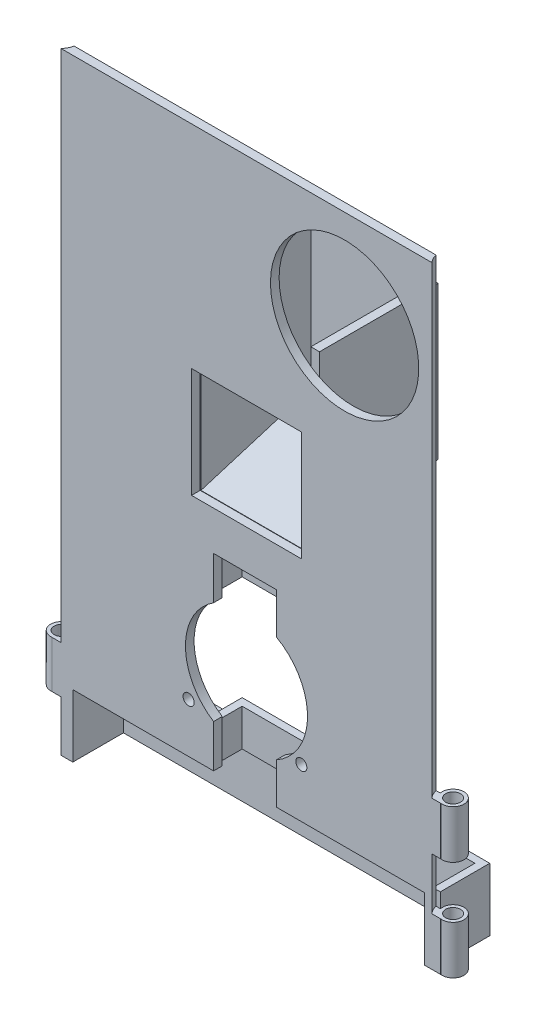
from build123d import *

# Parameters (mm, degrees)
SKETCH1_W                        = 62.865
SKETCH1_H                        = 99.06
BOSS_EXTRUDE1_DEPTH              = 1.4
SKETCH2_R                        = 1.75
BOSS_EXTRUDE2_DEPTH              = 99.06
TUBE_HOLE_DEPTH                  = 109.587853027
TUBE_HOLE_DEPTH_BACK             = 109.587853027
SKETCH7_R                        = 1.2
SKETCH8_R                        = 12
SKETCH8_W                        = 17.78
SKETCH8_H                        = 17.78
PANEL_HOLES_DEPTH                = 4.2
CUT_EXTRUDE1_DEPTH               = 4.2
CUT_EXTRUDE1_DEPTH_BACK          = 4.2
SKETCH9_R                        = 2.4
CUT_EXTRUDE2_START               = 12
SKETCH10_R                       = 2.4
CUT_EXTRUDE2_DEPTH               = 75.06
CUT_EXTRUDE3_START               = -3.8
SKETCH11_R                       = 2.4
CUT_EXTRUDE3_DEPTH               = 8.2
CUT_EXTRUDE4_START               = 87.06
SKETCH12_R                       = 2.4
CUT_EXTRUDE4_DEPTH               = 83.26
SKETCH13_W                       = 20.58
SKETCH13_H                       = 30.48
BOSS_EXTRUDE3_DEPTH              = 19.18
CUT_EXTRUDE5_DEPTH               = 110.914956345
CUT_EXTRUDE6_REACH               = 105.194
CUT_EXTRUDE6_OFFSET_FROM_SURFACE = 1.4
SKETCH14_W                       = 17.78
SKETCH14_H                       = 17.78
SKETCH16_W                       = 13.71246407
SKETCH16_H                       = 6
BOSS_EXTRUDE4_DEPTH              = 5
SKETCH17_W                       = 11.31246407
SKETCH17_H                       = 3.8
CUT_EXTRUDE7_DEPTH               = 90.494281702
SKETCH18_W                       = 59.276015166
SKETCH18_H                       = 10.16
BOSS_EXTRUDE5_DEPTH              = 8
SKETCH19_W                       = 56.876015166
SKETCH19_H                       = 9.973553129
CUT_EXTRUDE8_DEPTH               = 10.16
SKETCH20_R                       = 0.9
CUT_EXTRUDE9_DEPTH               = 8


with BuildPart() as part:
    # Sketch1 → Boss-Extrude1 (new body)
    with BuildSketch(Plane.XY):
        with Locations((31.4325, 49.53)):
            Rectangle(SKETCH1_W, SKETCH1_H)
    extrude(amount=BOSS_EXTRUDE1_DEPTH)

    # Sketch2 → Boss-Extrude2 (add)
    with BuildSketch(Plane(origin=(0, 0, 0), x_dir=(1, 0, 0), z_dir=(0, 1, 0))):
        with Locations((-0.25, 0.35)):
            Circle(SKETCH2_R)
        with Locations((63.115, 0.35)):
            Circle(SKETCH2_R)
    extrude(amount=BOSS_EXTRUDE2_DEPTH)

    # Sketch7 → Tube Hole (cut, two sides: drawn at the far end of the back side and taken through both)
    with BuildSketch(Plane(origin=(0, 12, 0), x_dir=(1, 0, 0), z_dir=(0, 1, 0)).offset(-TUBE_HOLE_DEPTH_BACK)):
        with Locations(Location((-0.25, 0.35, 0), (0, 0, 270))):
            Circle(SKETCH7_R)
        with Locations(Location((63.115, 0.35, 0), (0, 0, 90))):
            Circle(SKETCH7_R)
    extrude(amount=TUBE_HOLE_DEPTH + TUBE_HOLE_DEPTH_BACK, mode=Mode.SUBTRACT)

    # Sketch8 → Panel Holes (cut)
    with BuildSketch(Plane(origin=(0, 0, 0), x_dir=(-1, 0, 0), z_dir=(0, 0, -1))):
        with Locations((-47.3125, 83.18)):
            Circle(SKETCH8_R)
        with BuildLine():
            Line((-36.267227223, 16.786429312), (-36.267227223, 10.16))
            Line((-36.267227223, 10.16), (-26.107227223, 10.16))
            Line((-26.107227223, 10.16), (-26.107227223, 17.080765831))
            ThreePointArc((-26.107227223, 17.080765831), (-21.554838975, 25.4), (-26.107227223, 33.719234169))
            Line((-26.107227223, 33.719234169), (-26.107227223, 40.64))
            Line((-26.107227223, 40.64), (-36.267227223, 40.64))
            Line((-36.267227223, 40.64), (-36.267227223, 34.013570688))
            ThreePointArc((-36.267227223, 34.013570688), (-41.310161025, 25.4), (-36.267227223, 16.786429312))
        make_face()
        with Locations((-31.4325, 55.88)):
            Rectangle(SKETCH8_W, SKETCH8_H)
    extrude(amount=-PANEL_HOLES_DEPTH, mode=Mode.SUBTRACT)

    # Sketch9 → Cut-Extrude1 (cut, two sides: drawn at the far end of the back side and taken through both)
    with BuildSketch(Plane(origin=(0, 12, 0), x_dir=(1, 0, 0), z_dir=(0, 1, 0)).offset(-CUT_EXTRUDE1_DEPTH_BACK)):
        with Locations((63.115, 0.35)):
            Circle(SKETCH9_R)
    extrude(amount=CUT_EXTRUDE1_DEPTH + CUT_EXTRUDE1_DEPTH_BACK, mode=Mode.SUBTRACT)

    # Sketch10 → Cut-Extrude2 (cut)
    with BuildSketch(Plane(origin=(0, 12, 0), x_dir=(1, 0, 0), z_dir=(0, 1, 0)).offset(CUT_EXTRUDE2_START)):
        with Locations((63.115, 0.35)):
            Circle(SKETCH10_R)
    extrude(amount=CUT_EXTRUDE2_DEPTH, mode=Mode.SUBTRACT)

    # Sketch11 → Cut-Extrude3 (cut)
    with BuildSketch(Plane(origin=(0, 12, 0), x_dir=(1, 0, 0), z_dir=(0, 1, 0)).offset(CUT_EXTRUDE3_START)):
        with Locations((-0.25, 0.35)):
            Circle(SKETCH11_R)
    extrude(amount=-CUT_EXTRUDE3_DEPTH, mode=Mode.SUBTRACT)

    # Sketch12 → Cut-Extrude4 (cut)
    with BuildSketch(Plane(origin=(0, 12, 0), x_dir=(1, 0, 0), z_dir=(0, 1, 0)).offset(CUT_EXTRUDE4_START)):
        with Locations((-0.25, 0.35)):
            Circle(SKETCH12_R)
    extrude(amount=-CUT_EXTRUDE4_DEPTH, mode=Mode.SUBTRACT)

    # Sketch13 → Boss-Extrude3 (add)
    with BuildSketch(Plane(origin=(0, 0, 0), x_dir=(-1, 0, 0), z_dir=(0, 0, -1))):
        with Locations((-31.559798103, 60.83)):
            Rectangle(SKETCH13_W, SKETCH13_H)
    extrude(amount=BOSS_EXTRUDE3_DEPTH)

    # Sketch15 → Cut-Extrude5 (cut, through all)
    with BuildSketch(Plane.ZY.offset(-21.269798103)):
        Polygon((-19.18, 51.432), (0, 45.59), (-19.18, 45.59), align=None)
    extrude(amount=-CUT_EXTRUDE5_DEPTH, mode=Mode.SUBTRACT)

    # Cut-Extrude6: up to this face of the body (flat: up to its plane, moved by the offset)
    cut_extrude6_end = Plane(part.part.faces().sort_by_distance((31.559798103, 48.511, -9.59))[0]).offset(-CUT_EXTRUDE6_OFFSET_FROM_SURFACE)
    # Sketch14 → Cut-Extrude6 (cut, up to the picked face)
    with BuildSketch(Plane(origin=(0, 76.07, 0), x_dir=(1, 0, 0), z_dir=(0, 1, 0)), mode=Mode.PRIVATE) as cut_extrude6_sk1:
        with Locations((31.559798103, 8.89)):
            Rectangle(SKETCH14_W, SKETCH14_H)
    cut_extrude6_tool1 = split(extrude(cut_extrude6_sk1.sketch, amount=-CUT_EXTRUDE6_REACH, mode=Mode.PRIVATE), bisect_by=cut_extrude6_end, keep=Keep.BOTH, mode=Mode.PRIVATE)
    add(cut_extrude6_tool1.solids().sort_by(Axis((31.559798, 76.07, -8.89), (0, -1, 0)))[0], mode=Mode.SUBTRACT)

    # Sketch16 → Boss-Extrude4 (add)
    with BuildSketch(Plane(origin=(0, 0, 0), x_dir=(-1, 0, 0), z_dir=(0, 0, -1))):
        with Locations((-31.187227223, 37.460632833)):
            Rectangle(SKETCH16_W, SKETCH16_H)
        with Locations((-31.187227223, 13.339367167)):
            Rectangle(SKETCH16_W, SKETCH16_H)
    extrude(amount=BOSS_EXTRUDE4_DEPTH)

    # Sketch17 → Cut-Extrude7 (cut, through all)
    with BuildSketch(Plane(origin=(0, 40.460632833, 0), x_dir=(1, 0, 0), z_dir=(0, 1, 0))):
        with Locations((31.187227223, 1.9)):
            Rectangle(SKETCH17_W, SKETCH17_H)
    extrude(amount=-CUT_EXTRUDE7_DEPTH, mode=Mode.SUBTRACT)

    # Sketch18 → Boss-Extrude5 (add)
    with BuildSketch(Plane(origin=(0, 0, 0), x_dir=(-1, 0, 0), z_dir=(0, 0, -1))):
        with Locations((-31.762349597, 5.08)):
            Rectangle(SKETCH18_W, SKETCH18_H)
    extrude(amount=BOSS_EXTRUDE5_DEPTH)

    # Sketch19 → Cut-Extrude8 (cut)
    with BuildSketch(Plane.XZ):
        with Locations((31.762349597, -1.813223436)):
            Rectangle(SKETCH19_W, SKETCH19_H)
    extrude(amount=-CUT_EXTRUDE8_DEPTH, mode=Mode.SUBTRACT)

    # Sketch20 → Cut-Extrude9 (cut)
    with BuildSketch(Plane.XY.offset(1.4)):
        with Locations((40.306100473, 18.16)):
            Circle(SKETCH20_R)
        with Locations(Location((22.068353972, 18.16, 0), (0, 0, 180))):
            Circle(SKETCH20_R)
    extrude(amount=-CUT_EXTRUDE9_DEPTH, mode=Mode.SUBTRACT)


solid = part.part
